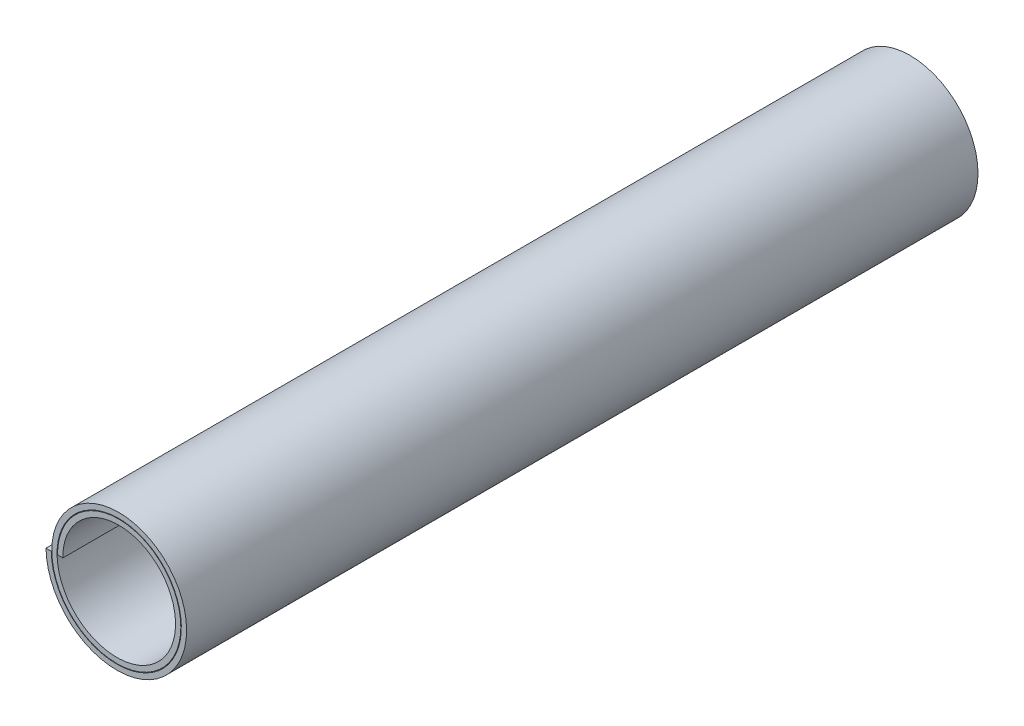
ISO-10303-21;
HEADER;
FILE_DESCRIPTION(('STEP AP214'),'2;1');
FILE_NAME('part.step','',(''),(''),'','','');
FILE_SCHEMA(('AUTOMOTIVE_DESIGN { 1 0 10303 214 1 1 1 1 }'));
ENDSEC;
DATA;
#1=APPLICATION_CONTEXT('core data for automotive mechanical design processes');
#2=APPLICATION_PROTOCOL_DEFINITION('international standard','automotive_design',2000,#1);
#3=PRODUCT_CONTEXT('',#1,'mechanical');
#4=PRODUCT('Part','Part','',(#3));
#5=PRODUCT_RELATED_PRODUCT_CATEGORY('part','',(#4));
#6=PRODUCT_DEFINITION_FORMATION('','',#4);
#7=PRODUCT_DEFINITION_CONTEXT('part definition',#1,'design');
#8=PRODUCT_DEFINITION('design','',#6,#7);
#9=PRODUCT_DEFINITION_SHAPE('','',#8);
#10=(LENGTH_UNIT() NAMED_UNIT(*) SI_UNIT(.MILLI.,.METRE.));
#11=(NAMED_UNIT(*) PLANE_ANGLE_UNIT() SI_UNIT($,.RADIAN.));
#12=(NAMED_UNIT(*) SI_UNIT($,.STERADIAN.) SOLID_ANGLE_UNIT());
#13=UNCERTAINTY_MEASURE_WITH_UNIT(LENGTH_MEASURE(1.E-05),#10,'distance_accuracy_value','');
#14=(GEOMETRIC_REPRESENTATION_CONTEXT(3) GLOBAL_UNCERTAINTY_ASSIGNED_CONTEXT((#13)) GLOBAL_UNIT_ASSIGNED_CONTEXT((#10,
#11,#12)) REPRESENTATION_CONTEXT('',''));
#15=CARTESIAN_POINT('',(0.,0.,0.));
#16=DIRECTION('',(0.,0.,1.));
#17=DIRECTION('',(1.,0.,0.));
#18=AXIS2_PLACEMENT_3D('',#15,#16,#17);
#19=CARTESIAN_POINT('',(-1.7272,0.,-9.52499999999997));
#20=DIRECTION('',(0.,1.,0.));
#21=DIRECTION('',(0.,0.,1.));
#22=AXIS2_PLACEMENT_3D('',#19,#20,#21);
#23=PLANE('',#22);
#24=DIRECTION('',(0.,0.,1.));
#25=VECTOR('',#24,1.);
#26=CARTESIAN_POINT('',(-1.7272,0.,-19.0499999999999));
#27=LINE('',#26,#25);
#28=CARTESIAN_POINT('',(-1.7272,0.,-19.0499999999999));
#29=VERTEX_POINT('',#28);
#30=CARTESIAN_POINT('',(-1.7272,0.,0.));
#31=VERTEX_POINT('',#30);
#32=EDGE_CURVE('E52',#29,#31,#27,.T.);
#33=ORIENTED_EDGE('',*,*,#32,.T.);
#34=DIRECTION('',(1.,0.,0.));
#35=VECTOR('',#34,1.);
#36=CARTESIAN_POINT('',(-1.7272,0.,0.));
#37=LINE('',#36,#35);
#38=CARTESIAN_POINT('',(-1.6002,0.,0.));
#39=VERTEX_POINT('',#38);
#40=EDGE_CURVE('E61',#31,#39,#37,.T.);
#41=ORIENTED_EDGE('',*,*,#40,.T.);
#42=DIRECTION('',(0.,0.,-1.));
#43=VECTOR('',#42,1.);
#44=CARTESIAN_POINT('',(-1.6002,0.,0.));
#45=LINE('',#44,#43);
#46=CARTESIAN_POINT('',(-1.6002,0.,-19.0499999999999));
#47=VERTEX_POINT('',#46);
#48=EDGE_CURVE('E94',#39,#47,#45,.T.);
#49=ORIENTED_EDGE('',*,*,#48,.T.);
#50=DIRECTION('',(-1.,0.,0.));
#51=VECTOR('',#50,1.);
#52=CARTESIAN_POINT('',(-1.6002,0.,-19.0499999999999));
#53=LINE('',#52,#51);
#54=EDGE_CURVE('E88',#47,#29,#53,.T.);
#55=ORIENTED_EDGE('',*,*,#54,.T.);
#56=EDGE_LOOP('',(#33,#41,#49,#55));
#57=FACE_BOUND('',#56,.T.);
#58=ADVANCED_FACE('F42',(#57),#23,.T.);
#59=CARTESIAN_POINT('',(-1.4478,0.,-9.52499999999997));
#60=DIRECTION('',(0.00248373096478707,-0.99999691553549,0.));
#61=DIRECTION('',(0.99999691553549,0.00248373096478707,0.));
#62=AXIS2_PLACEMENT_3D('',#59,#60,#61);
#63=PLANE('',#62);
#64=DIRECTION('',(0.,0.,1.));
#65=VECTOR('',#64,1.);
#66=CARTESIAN_POINT('',(-1.4478,0.,-9.52499999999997));
#67=LINE('',#66,#65);
#68=CARTESIAN_POINT('',(-1.4478,0.,-19.0499999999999));
#69=VERTEX_POINT('',#68);
#70=CARTESIAN_POINT('',(-1.4478,0.,0.));
#71=VERTEX_POINT('',#70);
#72=EDGE_CURVE('E13',#69,#71,#67,.T.);
#73=ORIENTED_EDGE('',*,*,#72,.F.);
#74=DIRECTION('',(-0.99999691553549,-0.00248373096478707,0.));
#75=VECTOR('',#74,1.);
#76=CARTESIAN_POINT('',(-1.32080039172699,0.000315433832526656,-19.0499999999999));
#77=LINE('',#76,#75);
#78=CARTESIAN_POINT('',(-1.32080039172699,0.000315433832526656,-19.0499999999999));
#79=VERTEX_POINT('',#78);
#80=EDGE_CURVE('E74',#79,#69,#77,.T.);
#81=ORIENTED_EDGE('',*,*,#80,.F.);
#82=DIRECTION('',(0.,0.,-1.));
#83=VECTOR('',#82,1.);
#84=CARTESIAN_POINT('',(-1.32080039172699,0.000315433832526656,-9.52499999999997));
#85=LINE('',#84,#83);
#86=CARTESIAN_POINT('',(-1.32080039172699,0.000315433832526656,0.));
#87=VERTEX_POINT('',#86);
#88=EDGE_CURVE('E100',#87,#79,#85,.T.);
#89=ORIENTED_EDGE('',*,*,#88,.F.);
#90=DIRECTION('',(0.99999691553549,0.00248373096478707,0.));
#91=VECTOR('',#90,1.);
#92=CARTESIAN_POINT('',(-1.3843001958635,0.00015771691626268,0.));
#93=LINE('',#92,#91);
#94=EDGE_CURVE('E103',#71,#87,#93,.T.);
#95=ORIENTED_EDGE('',*,*,#94,.F.);
#96=EDGE_LOOP('',(#73,#81,#89,#95));
#97=FACE_BOUND('',#96,.T.);
#98=ADVANCED_FACE('F151',(#97),#63,.T.);
#99=CARTESIAN_POINT('',(-1.7272,0.,-19.0499999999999));
#100=CARTESIAN_POINT('',(-1.72428957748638,-0.226089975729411,-19.0499999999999));
#101=CARTESIAN_POINT('',(-1.67643041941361,-0.450919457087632,-19.0499999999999));
#102=CARTESIAN_POINT('',(-1.49888579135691,-0.864339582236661,-19.0499999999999));
#103=CARTESIAN_POINT('',(-1.36927825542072,-1.05277164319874,-19.0499999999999));
#104=CARTESIAN_POINT('',(-1.04865570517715,-1.36516231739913,-19.0499999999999));
#105=CARTESIAN_POINT('',(-0.857772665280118,-1.48900502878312,-19.0499999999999));
#106=CARTESIAN_POINT('',(-0.444121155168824,-1.65404468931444,-19.0499999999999));
#107=CARTESIAN_POINT('',(-0.22151813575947,-1.69518540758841,-19.0499999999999));
#108=CARTESIAN_POINT('',(0.22151813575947,-1.68936459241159,-19.0499999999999));
#109=CARTESIAN_POINT('',(0.441777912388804,-1.64241442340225,-19.0499999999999));
#110=CARTESIAN_POINT('',(0.846750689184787,-1.46836880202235,-19.0499999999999));
#111=CARTESIAN_POINT('',(1.03130859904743,-1.34134989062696,-19.0499999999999));
#112=CARTESIAN_POINT('',(1.33723395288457,-1.02719266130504,-19.0499999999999));
#113=CARTESIAN_POINT('',(1.45848803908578,-0.840183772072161,-19.0499999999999));
#114=CARTESIAN_POINT('',(1.62002869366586,-0.43497961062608,-19.0499999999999));
#115=CARTESIAN_POINT('',(1.66026040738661,-0.21694646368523,-19.0499999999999));
#116=CARTESIAN_POINT('',(1.6544395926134,0.216946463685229,-19.0499999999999));
#117=CARTESIAN_POINT('',(1.60839842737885,0.432636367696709,-19.0499999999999));
#118=CARTESIAN_POINT('',(1.43785181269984,0.82916179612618,-19.0499999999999));
#119=CARTESIAN_POINT('',(1.31342152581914,1.00984555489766,-19.0499999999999));
#120=CARTESIAN_POINT('',(1.00572961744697,1.30930558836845,-19.0499999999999));
#121=CARTESIAN_POINT('',(0.822594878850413,1.42797104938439,-19.0499999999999));
#122=CARTESIAN_POINT('',(0.425838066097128,1.58601269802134,-19.0499999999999));
#123=CARTESIAN_POINT('',(0.212374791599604,1.62533540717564,-19.0499999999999));
#124=CARTESIAN_POINT('',(-0.212374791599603,1.61951459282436,-19.0499999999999));
#125=CARTESIAN_POINT('',(-0.423494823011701,1.57438243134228,-19.0499999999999));
#126=CARTESIAN_POINT('',(-0.811572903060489,1.4073348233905,-19.0499999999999));
#127=CARTESIAN_POINT('',(-0.988382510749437,1.28549316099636,-19.0499999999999));
#128=CARTESIAN_POINT('',(-1.28137722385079,0.984266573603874,-19.0499999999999));
#129=CARTESIAN_POINT('',(-1.39745405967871,0.805005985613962,-19.0499999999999));
#130=CARTESIAN_POINT('',(-1.55199670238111,0.416696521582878,-19.0499999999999));
#131=CARTESIAN_POINT('',(-1.59041040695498,0.207803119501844,-19.0499999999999));
#132=CARTESIAN_POINT('',(-1.58458959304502,-0.207803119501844,-19.0499999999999));
#133=CARTESIAN_POINT('',(-1.5403664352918,-0.414353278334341,-19.0499999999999));
#134=CARTESIAN_POINT('',(-1.37681783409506,-0.793984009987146,-19.0499999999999));
#135=CARTESIAN_POINT('',(-1.25756479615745,-0.966919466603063,-19.0499999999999));
#136=CARTESIAN_POINT('',(-0.962803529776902,-1.25344885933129,-19.0499999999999));
#137=CARTESIAN_POINT('',(-0.787417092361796,-1.36693706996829,-19.0499999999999));
#138=CARTESIAN_POINT('',(-0.407554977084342,-1.51798070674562,-19.0499999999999));
#139=CARTESIAN_POINT('',(-0.203231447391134,-1.55548540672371,-19.0499999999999));
#140=CARTESIAN_POINT('',(0.203231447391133,-1.5496645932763,-19.0499999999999));
#141=CARTESIAN_POINT('',(0.405211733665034,-1.50635043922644,-19.0499999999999));
#142=CARTESIAN_POINT('',(0.776395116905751,-1.3463008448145,-19.0499999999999));
#143=CARTESIAN_POINT('',(0.945456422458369,-1.22963643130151,-19.0499999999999));
#144=CARTESIAN_POINT('',(1.2255204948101,-0.941340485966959,-19.0499999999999));
#145=CARTESIAN_POINT('',(1.3364200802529,-0.769828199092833,-19.0499999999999));
#146=CARTESIAN_POINT('',(1.48396471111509,-0.398413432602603,-19.0499999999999));
#147=CARTESIAN_POINT('',(1.52056040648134,-0.198659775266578,-19.0499999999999));
#148=CARTESIAN_POINT('',(1.51473959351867,0.198659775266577,-19.0499999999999));
#149=CARTESIAN_POINT('',(1.47233444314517,0.396070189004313,-19.0499999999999));
#150=CARTESIAN_POINT('',(1.31578385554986,0.75880622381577,-19.0499999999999));
#151=CARTESIAN_POINT('',(1.20170806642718,0.923993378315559,-19.0499999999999));
#152=CARTESIAN_POINT('',(0.919877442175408,1.19759213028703,-19.0499999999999));
#153=CARTESIAN_POINT('',(0.75223930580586,1.30590309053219,-19.0499999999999));
#154=CARTESIAN_POINT('',(0.389271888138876,1.44994871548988,-19.0499999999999));
#155=CARTESIAN_POINT('',(0.194088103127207,1.48563540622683,-19.0499999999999));
#156=CARTESIAN_POINT('',(-0.194088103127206,1.47981459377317,-19.0499999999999));
#157=CARTESIAN_POINT('',(-0.386928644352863,1.43831844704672,-19.0499999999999));
#158=CARTESIAN_POINT('',(-0.74121733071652,1.2852668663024,-19.0499999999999));
#159=CARTESIAN_POINT('',(-0.902530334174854,1.17377970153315,-19.0499999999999));
#160=CARTESIAN_POINT('',(-1.16966376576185,0.898414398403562,-19.0499999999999));
#161=CARTESIAN_POINT('',(-1.27538610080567,0.734650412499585,-19.0499999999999));
#162=CARTESIAN_POINT('',(-1.41593271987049,0.380130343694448,-19.0499999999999));
#163=CARTESIAN_POINT('',(-1.45071041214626,0.189516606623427,-19.0499999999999));
#164=CARTESIAN_POINT('',(-1.4478,0.,-19.0499999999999));
#165=CARTESIAN_POINT('',(-1.7272,0.,0.));
#166=CARTESIAN_POINT('',(-1.72428957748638,-0.22608997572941,0.));
#167=CARTESIAN_POINT('',(-1.67643041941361,-0.450919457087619,0.));
#168=CARTESIAN_POINT('',(-1.4988857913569,-0.864339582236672,0.));
#169=CARTESIAN_POINT('',(-1.36927825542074,-1.05277164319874,0.));
#170=CARTESIAN_POINT('',(-1.04865570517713,-1.36516231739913,0.));
#171=CARTESIAN_POINT('',(-0.857772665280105,-1.48900502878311,0.));
#172=CARTESIAN_POINT('',(-0.444121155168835,-1.65404468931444,0.));
#173=CARTESIAN_POINT('',(-0.22151813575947,-1.69518540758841,0.));
#174=CARTESIAN_POINT('',(0.22151813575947,-1.68936459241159,0.));
#175=CARTESIAN_POINT('',(0.441777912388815,-1.64241442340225,0.));
#176=CARTESIAN_POINT('',(0.846750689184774,-1.46836880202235,0.));
#177=CARTESIAN_POINT('',(1.0313085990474,-1.34134989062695,0.));
#178=CARTESIAN_POINT('',(1.33723395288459,-1.02719266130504,0.));
#179=CARTESIAN_POINT('',(1.45848803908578,-0.84018377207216,0.));
#180=CARTESIAN_POINT('',(1.62002869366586,-0.434979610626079,0.));
#181=CARTESIAN_POINT('',(1.66026040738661,-0.216946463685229,0.));
#182=CARTESIAN_POINT('',(1.65443959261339,0.216946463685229,0.));
#183=CARTESIAN_POINT('',(1.60839842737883,0.432636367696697,0.));
#184=CARTESIAN_POINT('',(1.43785181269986,0.829161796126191,0.));
#185=CARTESIAN_POINT('',(1.31342152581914,1.00984555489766,0.));
#186=CARTESIAN_POINT('',(1.00572961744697,1.30930558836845,0.));
#187=CARTESIAN_POINT('',(0.822594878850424,1.42797104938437,0.));
#188=CARTESIAN_POINT('',(0.425838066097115,1.58601269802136,0.));
#189=CARTESIAN_POINT('',(0.212374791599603,1.62533540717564,0.));
#190=CARTESIAN_POINT('',(-0.212374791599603,1.61951459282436,0.));
#191=CARTESIAN_POINT('',(-0.423494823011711,1.57438243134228,0.));
#192=CARTESIAN_POINT('',(-0.811572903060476,1.40733482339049,0.));
#193=CARTESIAN_POINT('',(-0.988382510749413,1.28549316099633,0.));
#194=CARTESIAN_POINT('',(-1.28137722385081,0.984266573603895,0.));
#195=CARTESIAN_POINT('',(-1.39745405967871,0.805005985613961,0.));
#196=CARTESIAN_POINT('',(-1.55199670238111,0.416696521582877,0.));
#197=CARTESIAN_POINT('',(-1.59041040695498,0.207803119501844,0.));
#198=CARTESIAN_POINT('',(-1.58458959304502,-0.207803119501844,0.));
#199=CARTESIAN_POINT('',(-1.5403664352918,-0.41435327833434,0.));
#200=CARTESIAN_POINT('',(-1.37681783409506,-0.793984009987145,0.));
#201=CARTESIAN_POINT('',(-1.25756479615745,-0.966919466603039,0.));
#202=CARTESIAN_POINT('',(-0.962803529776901,-1.25344885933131,0.));
#203=CARTESIAN_POINT('',(-0.787417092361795,-1.36693706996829,0.));
#204=CARTESIAN_POINT('',(-0.407554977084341,-1.51798070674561,0.));
#205=CARTESIAN_POINT('',(-0.203231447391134,-1.5554854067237,0.));
#206=CARTESIAN_POINT('',(0.203231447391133,-1.5496645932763,0.));
#207=CARTESIAN_POINT('',(0.405211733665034,-1.50635043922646,0.));
#208=CARTESIAN_POINT('',(0.77639511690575,-1.34630084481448,0.));
#209=CARTESIAN_POINT('',(0.945456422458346,-1.22963643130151,0.));
#210=CARTESIAN_POINT('',(1.22552049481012,-0.941340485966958,0.));
#211=CARTESIAN_POINT('',(1.33642008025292,-0.769828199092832,0.));
#212=CARTESIAN_POINT('',(1.48396471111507,-0.398413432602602,0.));
#213=CARTESIAN_POINT('',(1.52056040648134,-0.198659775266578,0.));
#214=CARTESIAN_POINT('',(1.51473959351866,0.198659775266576,0.));
#215=CARTESIAN_POINT('',(1.47233444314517,0.396070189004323,0.));
#216=CARTESIAN_POINT('',(1.31578385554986,0.758806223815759,0.));
#217=CARTESIAN_POINT('',(1.20170806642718,0.923993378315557,0.));
#218=CARTESIAN_POINT('',(0.919877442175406,1.19759213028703,0.));
#219=CARTESIAN_POINT('',(0.752239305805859,1.30590309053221,0.));
#220=CARTESIAN_POINT('',(0.389271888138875,1.44994871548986,0.));
#221=CARTESIAN_POINT('',(0.194088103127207,1.48563540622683,0.));
#222=CARTESIAN_POINT('',(-0.194088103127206,1.47981459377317,0.));
#223=CARTESIAN_POINT('',(-0.386928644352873,1.43831844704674,0.));
#224=CARTESIAN_POINT('',(-0.741217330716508,1.28526686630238,0.));
#225=CARTESIAN_POINT('',(-0.902530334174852,1.17377970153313,0.));
#226=CARTESIAN_POINT('',(-1.16966376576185,0.898414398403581,0.));
#227=CARTESIAN_POINT('',(-1.27538610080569,0.734650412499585,0.));
#228=CARTESIAN_POINT('',(-1.41593271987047,0.380130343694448,0.));
#229=CARTESIAN_POINT('',(-1.45071041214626,0.189516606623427,0.));
#230=CARTESIAN_POINT('',(-1.4478,0.,0.));
#231=B_SPLINE_SURFACE_WITH_KNOTS('',1,3,((#99,#100,#101,#102,#103,#104,#105,#106,#107,#108,#109,
#110,#111,#112,#113,#114,#115,#116,#117,#118,#119,#120,#121,#122,#123,#124,#125,#126,#127,#128,
#129,#130,#131,#132,#133,#134,#135,#136,#137,#138,#139,#140,#141,#142,#143,#144,#145,#146,#147,
#148,#149,#150,#151,#152,#153,#154,#155,#156,#157,#158,#159,#160,#161,#162,#163,#164),(#165,
#166,#167,#168,#169,#170,#171,#172,#173,#174,#175,#176,#177,#178,#179,#180,#181,#182,#183,#184,
#185,#186,#187,#188,#189,#190,#191,#192,#193,#194,#195,#196,#197,#198,#199,#200,#201,#202,#203,
#204,#205,#206,#207,#208,#209,#210,#211,#212,#213,#214,#215,#216,#217,#218,#219,#220,#221,#222,
#223,#224,#225,#226,#227,#228,#229,#230)),.UNSPECIFIED.,.F.,.F.,.F.,(2,2),(4,2,2,2,2,2,2,2,2,2,
2,2,2,2,2,2,2,2,2,2,2,2,2,2,2,2,2,2,2,2,2,2,4),(0.,0.496688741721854),(0.,0.03125,0.0625,
0.09375,0.125,0.15625,0.1875,0.21875,0.25,0.28125,0.3125,0.34375,0.375,0.40625,0.4375,0.46875,
0.5,0.53125,0.5625,0.59375,0.625,0.65625,0.6875,0.71875,0.75,0.78125,0.8125,0.84375,0.875,
0.90625,0.9375,0.96875,1.),.UNSPECIFIED.);
#232=CARTESIAN_POINT('',(-1.7272,0.,-19.0499999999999));
#233=CARTESIAN_POINT('',(-1.72428957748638,-0.226089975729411,-19.0499999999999));
#234=CARTESIAN_POINT('',(-1.67643041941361,-0.450919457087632,-19.0499999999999));
#235=CARTESIAN_POINT('',(-1.49888579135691,-0.864339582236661,-19.0499999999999));
#236=CARTESIAN_POINT('',(-1.36927825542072,-1.05277164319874,-19.0499999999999));
#237=CARTESIAN_POINT('',(-1.04865570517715,-1.36516231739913,-19.0499999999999));
#238=CARTESIAN_POINT('',(-0.857772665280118,-1.48900502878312,-19.0499999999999));
#239=CARTESIAN_POINT('',(-0.444121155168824,-1.65404468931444,-19.0499999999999));
#240=CARTESIAN_POINT('',(-0.22151813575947,-1.69518540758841,-19.0499999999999));
#241=CARTESIAN_POINT('',(0.22151813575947,-1.68936459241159,-19.0499999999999));
#242=CARTESIAN_POINT('',(0.441777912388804,-1.64241442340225,-19.0499999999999));
#243=CARTESIAN_POINT('',(0.846750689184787,-1.46836880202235,-19.0499999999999));
#244=CARTESIAN_POINT('',(1.03130859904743,-1.34134989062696,-19.0499999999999));
#245=CARTESIAN_POINT('',(1.33723395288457,-1.02719266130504,-19.0499999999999));
#246=CARTESIAN_POINT('',(1.45848803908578,-0.840183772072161,-19.0499999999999));
#247=CARTESIAN_POINT('',(1.62002869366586,-0.43497961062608,-19.0499999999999));
#248=CARTESIAN_POINT('',(1.66026040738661,-0.21694646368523,-19.0499999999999));
#249=CARTESIAN_POINT('',(1.6544395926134,0.216946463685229,-19.0499999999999));
#250=CARTESIAN_POINT('',(1.60839842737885,0.432636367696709,-19.0499999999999));
#251=CARTESIAN_POINT('',(1.43785181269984,0.82916179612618,-19.0499999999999));
#252=CARTESIAN_POINT('',(1.31342152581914,1.00984555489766,-19.0499999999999));
#253=CARTESIAN_POINT('',(1.00572961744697,1.30930558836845,-19.0499999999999));
#254=CARTESIAN_POINT('',(0.822594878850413,1.42797104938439,-19.0499999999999));
#255=CARTESIAN_POINT('',(0.425838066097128,1.58601269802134,-19.0499999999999));
#256=CARTESIAN_POINT('',(0.212374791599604,1.62533540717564,-19.0499999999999));
#257=CARTESIAN_POINT('',(-0.212374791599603,1.61951459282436,-19.0499999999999));
#258=CARTESIAN_POINT('',(-0.423494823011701,1.57438243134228,-19.0499999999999));
#259=CARTESIAN_POINT('',(-0.811572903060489,1.4073348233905,-19.0499999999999));
#260=CARTESIAN_POINT('',(-0.988382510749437,1.28549316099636,-19.0499999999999));
#261=CARTESIAN_POINT('',(-1.28137722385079,0.984266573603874,-19.0499999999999));
#262=CARTESIAN_POINT('',(-1.39745405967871,0.805005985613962,-19.0499999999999));
#263=CARTESIAN_POINT('',(-1.55199670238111,0.416696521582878,-19.0499999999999));
#264=CARTESIAN_POINT('',(-1.59041040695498,0.207803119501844,-19.0499999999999));
#265=CARTESIAN_POINT('',(-1.58458959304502,-0.207803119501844,-19.0499999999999));
#266=CARTESIAN_POINT('',(-1.5403664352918,-0.414353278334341,-19.0499999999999));
#267=CARTESIAN_POINT('',(-1.37681783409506,-0.793984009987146,-19.0499999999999));
#268=CARTESIAN_POINT('',(-1.25756479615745,-0.966919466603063,-19.0499999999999));
#269=CARTESIAN_POINT('',(-0.962803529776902,-1.25344885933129,-19.0499999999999));
#270=CARTESIAN_POINT('',(-0.787417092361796,-1.36693706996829,-19.0499999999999));
#271=CARTESIAN_POINT('',(-0.407554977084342,-1.51798070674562,-19.0499999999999));
#272=CARTESIAN_POINT('',(-0.203231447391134,-1.55548540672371,-19.0499999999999));
#273=CARTESIAN_POINT('',(0.203231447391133,-1.5496645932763,-19.0499999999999));
#274=CARTESIAN_POINT('',(0.405211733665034,-1.50635043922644,-19.0499999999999));
#275=CARTESIAN_POINT('',(0.776395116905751,-1.3463008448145,-19.0499999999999));
#276=CARTESIAN_POINT('',(0.945456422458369,-1.22963643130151,-19.0499999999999));
#277=CARTESIAN_POINT('',(1.2255204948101,-0.941340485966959,-19.0499999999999));
#278=CARTESIAN_POINT('',(1.3364200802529,-0.769828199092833,-19.0499999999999));
#279=CARTESIAN_POINT('',(1.48396471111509,-0.398413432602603,-19.0499999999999));
#280=CARTESIAN_POINT('',(1.52056040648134,-0.198659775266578,-19.0499999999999));
#281=CARTESIAN_POINT('',(1.51473959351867,0.198659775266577,-19.0499999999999));
#282=CARTESIAN_POINT('',(1.47233444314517,0.396070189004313,-19.0499999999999));
#283=CARTESIAN_POINT('',(1.31578385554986,0.75880622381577,-19.0499999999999));
#284=CARTESIAN_POINT('',(1.20170806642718,0.923993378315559,-19.0499999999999));
#285=CARTESIAN_POINT('',(0.919877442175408,1.19759213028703,-19.0499999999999));
#286=CARTESIAN_POINT('',(0.75223930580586,1.30590309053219,-19.0499999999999));
#287=CARTESIAN_POINT('',(0.389271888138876,1.44994871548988,-19.0499999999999));
#288=CARTESIAN_POINT('',(0.194088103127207,1.48563540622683,-19.0499999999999));
#289=CARTESIAN_POINT('',(-0.194088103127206,1.47981459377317,-19.0499999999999));
#290=CARTESIAN_POINT('',(-0.386928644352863,1.43831844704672,-19.0499999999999));
#291=CARTESIAN_POINT('',(-0.74121733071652,1.2852668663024,-19.0499999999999));
#292=CARTESIAN_POINT('',(-0.902530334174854,1.17377970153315,-19.0499999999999));
#293=CARTESIAN_POINT('',(-1.16966376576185,0.898414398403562,-19.0499999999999));
#294=CARTESIAN_POINT('',(-1.27538610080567,0.734650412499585,-19.0499999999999));
#295=CARTESIAN_POINT('',(-1.41593271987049,0.380130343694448,-19.0499999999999));
#296=CARTESIAN_POINT('',(-1.45071041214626,0.189516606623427,-19.0499999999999));
#297=CARTESIAN_POINT('',(-1.4478,0.,-19.0499999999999));
#298=B_SPLINE_CURVE_WITH_KNOTS('',3,(#232,#233,#234,#235,#236,#237,#238,#239,#240,#241,#242,
#243,#244,#245,#246,#247,#248,#249,#250,#251,#252,#253,#254,#255,#256,#257,#258,#259,#260,#261,
#262,#263,#264,#265,#266,#267,#268,#269,#270,#271,#272,#273,#274,#275,#276,#277,#278,#279,#280,
#281,#282,#283,#284,#285,#286,#287,#288,#289,#290,#291,#292,#293,#294,#295,#296,#297),
.UNSPECIFIED.,.F.,.F.,(4,2,2,2,2,2,2,2,2,2,2,2,2,2,2,2,2,2,2,2,2,2,2,2,2,2,2,2,2,2,2,2,4),(0.,
0.03125,0.0625,0.09375,0.125,0.15625,0.1875,0.21875,0.25,0.28125,0.3125,0.34375,0.375,0.40625,
0.4375,0.46875,0.5,0.53125,0.5625,0.59375,0.625,0.65625,0.6875,0.71875,0.75,0.78125,0.8125,
0.84375,0.875,0.90625,0.9375,0.96875,1.),.UNSPECIFIED.);
#299=EDGE_CURVE('E117',#29,#69,#298,.T.);
#300=CARTESIAN_POINT('',(-1.7272,0.,0.));
#301=CARTESIAN_POINT('',(-1.72428957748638,-0.22608997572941,0.));
#302=CARTESIAN_POINT('',(-1.67643041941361,-0.450919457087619,0.));
#303=CARTESIAN_POINT('',(-1.4988857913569,-0.864339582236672,0.));
#304=CARTESIAN_POINT('',(-1.36927825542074,-1.05277164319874,0.));
#305=CARTESIAN_POINT('',(-1.04865570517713,-1.36516231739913,0.));
#306=CARTESIAN_POINT('',(-0.857772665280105,-1.48900502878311,0.));
#307=CARTESIAN_POINT('',(-0.444121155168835,-1.65404468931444,0.));
#308=CARTESIAN_POINT('',(-0.22151813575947,-1.69518540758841,0.));
#309=CARTESIAN_POINT('',(0.22151813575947,-1.68936459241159,0.));
#310=CARTESIAN_POINT('',(0.441777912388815,-1.64241442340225,0.));
#311=CARTESIAN_POINT('',(0.846750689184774,-1.46836880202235,0.));
#312=CARTESIAN_POINT('',(1.0313085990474,-1.34134989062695,0.));
#313=CARTESIAN_POINT('',(1.33723395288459,-1.02719266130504,0.));
#314=CARTESIAN_POINT('',(1.45848803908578,-0.84018377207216,0.));
#315=CARTESIAN_POINT('',(1.62002869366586,-0.434979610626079,0.));
#316=CARTESIAN_POINT('',(1.66026040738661,-0.216946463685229,0.));
#317=CARTESIAN_POINT('',(1.65443959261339,0.216946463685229,0.));
#318=CARTESIAN_POINT('',(1.60839842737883,0.432636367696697,0.));
#319=CARTESIAN_POINT('',(1.43785181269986,0.829161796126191,0.));
#320=CARTESIAN_POINT('',(1.31342152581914,1.00984555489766,0.));
#321=CARTESIAN_POINT('',(1.00572961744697,1.30930558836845,0.));
#322=CARTESIAN_POINT('',(0.822594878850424,1.42797104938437,0.));
#323=CARTESIAN_POINT('',(0.425838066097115,1.58601269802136,0.));
#324=CARTESIAN_POINT('',(0.212374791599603,1.62533540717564,0.));
#325=CARTESIAN_POINT('',(-0.212374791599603,1.61951459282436,0.));
#326=CARTESIAN_POINT('',(-0.423494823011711,1.57438243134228,0.));
#327=CARTESIAN_POINT('',(-0.811572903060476,1.40733482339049,0.));
#328=CARTESIAN_POINT('',(-0.988382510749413,1.28549316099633,0.));
#329=CARTESIAN_POINT('',(-1.28137722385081,0.984266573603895,0.));
#330=CARTESIAN_POINT('',(-1.39745405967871,0.805005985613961,0.));
#331=CARTESIAN_POINT('',(-1.55199670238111,0.416696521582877,0.));
#332=CARTESIAN_POINT('',(-1.59041040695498,0.207803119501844,0.));
#333=CARTESIAN_POINT('',(-1.58458959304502,-0.207803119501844,0.));
#334=CARTESIAN_POINT('',(-1.5403664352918,-0.41435327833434,0.));
#335=CARTESIAN_POINT('',(-1.37681783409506,-0.793984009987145,0.));
#336=CARTESIAN_POINT('',(-1.25756479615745,-0.966919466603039,0.));
#337=CARTESIAN_POINT('',(-0.962803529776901,-1.25344885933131,0.));
#338=CARTESIAN_POINT('',(-0.787417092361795,-1.36693706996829,0.));
#339=CARTESIAN_POINT('',(-0.407554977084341,-1.51798070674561,0.));
#340=CARTESIAN_POINT('',(-0.203231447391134,-1.5554854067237,0.));
#341=CARTESIAN_POINT('',(0.203231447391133,-1.5496645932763,0.));
#342=CARTESIAN_POINT('',(0.405211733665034,-1.50635043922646,0.));
#343=CARTESIAN_POINT('',(0.77639511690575,-1.34630084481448,0.));
#344=CARTESIAN_POINT('',(0.945456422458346,-1.22963643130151,0.));
#345=CARTESIAN_POINT('',(1.22552049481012,-0.941340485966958,0.));
#346=CARTESIAN_POINT('',(1.33642008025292,-0.769828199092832,0.));
#347=CARTESIAN_POINT('',(1.48396471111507,-0.398413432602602,0.));
#348=CARTESIAN_POINT('',(1.52056040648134,-0.198659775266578,0.));
#349=CARTESIAN_POINT('',(1.51473959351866,0.198659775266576,0.));
#350=CARTESIAN_POINT('',(1.47233444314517,0.396070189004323,0.));
#351=CARTESIAN_POINT('',(1.31578385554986,0.758806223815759,0.));
#352=CARTESIAN_POINT('',(1.20170806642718,0.923993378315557,0.));
#353=CARTESIAN_POINT('',(0.919877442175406,1.19759213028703,0.));
#354=CARTESIAN_POINT('',(0.752239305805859,1.30590309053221,0.));
#355=CARTESIAN_POINT('',(0.389271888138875,1.44994871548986,0.));
#356=CARTESIAN_POINT('',(0.194088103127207,1.48563540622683,0.));
#357=CARTESIAN_POINT('',(-0.194088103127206,1.47981459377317,0.));
#358=CARTESIAN_POINT('',(-0.386928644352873,1.43831844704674,0.));
#359=CARTESIAN_POINT('',(-0.741217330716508,1.28526686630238,0.));
#360=CARTESIAN_POINT('',(-0.902530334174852,1.17377970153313,0.));
#361=CARTESIAN_POINT('',(-1.16966376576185,0.898414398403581,0.));
#362=CARTESIAN_POINT('',(-1.27538610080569,0.734650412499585,0.));
#363=CARTESIAN_POINT('',(-1.41593271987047,0.380130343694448,0.));
#364=CARTESIAN_POINT('',(-1.45071041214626,0.189516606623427,0.));
#365=CARTESIAN_POINT('',(-1.4478,0.,0.));
#366=B_SPLINE_CURVE_WITH_KNOTS('',3,(#300,#301,#302,#303,#304,#305,#306,#307,#308,#309,#310,
#311,#312,#313,#314,#315,#316,#317,#318,#319,#320,#321,#322,#323,#324,#325,#326,#327,#328,#329,
#330,#331,#332,#333,#334,#335,#336,#337,#338,#339,#340,#341,#342,#343,#344,#345,#346,#347,#348,
#349,#350,#351,#352,#353,#354,#355,#356,#357,#358,#359,#360,#361,#362,#363,#364,#365),
.UNSPECIFIED.,.F.,.F.,(4,2,2,2,2,2,2,2,2,2,2,2,2,2,2,2,2,2,2,2,2,2,2,2,2,2,2,2,2,2,2,2,4),(0.,
0.03125,0.0625,0.09375,0.125,0.15625,0.1875,0.21875,0.25,0.28125,0.3125,0.34375,0.375,0.40625,
0.4375,0.46875,0.5,0.53125,0.5625,0.59375,0.625,0.65625,0.6875,0.71875,0.75,0.78125,0.8125,
0.84375,0.875,0.90625,0.9375,0.96875,1.),.UNSPECIFIED.);
#367=EDGE_CURVE('E107',#31,#71,#366,.T.);
#368=ORIENTED_EDGE('',*,*,#32,.F.);
#369=ORIENTED_EDGE('',*,*,#299,.T.);
#370=ORIENTED_EDGE('',*,*,#72,.T.);
#371=ORIENTED_EDGE('',*,*,#367,.F.);
#372=EDGE_LOOP('',(#368,#369,#370,#371));
#373=FACE_BOUND('',#372,.T.);
#374=ADVANCED_FACE('F152',(#373),#231,.F.);
#375=CARTESIAN_POINT('',(-1.7272,0.,0.));
#376=DIRECTION('',(0.,0.,-1.));
#377=DIRECTION('',(1.,0.,0.));
#378=AXIS2_PLACEMENT_3D('',#375,#376,#377);
#379=PLANE('',#378);
#380=ORIENTED_EDGE('',*,*,#40,.F.);
#381=ORIENTED_EDGE('',*,*,#367,.T.);
#382=ORIENTED_EDGE('',*,*,#94,.T.);
#383=CARTESIAN_POINT('',(-1.6002,0.,0.));
#384=CARTESIAN_POINT('',(-1.59728957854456,-0.209254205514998,0.));
#385=CARTESIAN_POINT('',(-1.55265679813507,-0.417865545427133,0.));
#386=CARTESIAN_POINT('',(-1.38800036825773,-0.800176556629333,0.));
#387=CARTESIAN_POINT('',(-1.2675806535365,-0.974860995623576,0.));
#388=CARTESIAN_POINT('',(-0.970771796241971,-1.26344423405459,0.));
#389=CARTESIAN_POINT('',(-0.793638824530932,-1.37810271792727,0.));
#390=CARTESIAN_POINT('',(-0.411099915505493,-1.53026233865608,0.));
#391=CARTESIAN_POINT('',(-0.204715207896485,-1.56818094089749,0.));
#392=CARTESIAN_POINT('',(0.204647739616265,-1.56236906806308,0.));
#393=CARTESIAN_POINT('',(0.408690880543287,-1.51864963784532,0.));
#394=CARTESIAN_POINT('',(0.782557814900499,-1.35750064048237,0.));
#395=CARTESIAN_POINT('',(0.953370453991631,-1.23967334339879,0.));
#396=CARTESIAN_POINT('',(1.23549468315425,-0.949336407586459,0.));
#397=CARTESIAN_POINT('',(1.34756820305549,-0.776080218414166,0.));
#398=CARTESIAN_POINT('',(1.49623726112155,-0.401992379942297,0.));
#399=CARTESIAN_POINT('',(1.53325129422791,-0.200178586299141,0.));
#400=CARTESIAN_POINT('',(1.5274487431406,0.200040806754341,0.));
#401=CARTESIAN_POINT('',(1.48464286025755,0.399514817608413,0.));
#402=CARTESIAN_POINT('',(1.32700165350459,0.764937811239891,0.));
#403=CARTESIAN_POINT('',(1.21176693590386,0.931878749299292,0.));
#404=CARTESIAN_POINT('',(0.927902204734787,1.20754423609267,0.));
#405=CARTESIAN_POINT('',(0.758522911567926,1.3170329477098,0.));
#406=CARTESIAN_POINT('',(0.392886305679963,1.46221180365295,0.));
#407=CARTESIAN_POINT('',(0.19564347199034,1.49832145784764,0.));
#408=CARTESIAN_POINT('',(-0.195432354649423,1.49252862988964,0.));
#409=CARTESIAN_POINT('',(-0.390337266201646,1.45063649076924,0.));
#410=CARTESIAN_POINT('',(-0.747316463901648,1.29650345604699,0.));
#411=CARTESIAN_POINT('',(-0.910385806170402,1.18386149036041,0.));
#412=CARTESIAN_POINT('',(-1.17959283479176,0.906469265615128,0.));
#413=CARTESIAN_POINT('',(-1.28649690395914,0.740966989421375,0.));
#414=CARTESIAN_POINT('',(-1.42818594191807,0.383781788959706,0.));
#415=CARTESIAN_POINT('',(-1.46339141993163,0.191109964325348,0.));
#416=CARTESIAN_POINT('',(-1.45760874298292,-0.190822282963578,0.));
#417=CARTESIAN_POINT('',(-1.41663055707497,-0.381158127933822,0.));
#418=CARTESIAN_POINT('',(-1.26600610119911,-0.729693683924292,0.));
#419=CARTESIAN_POINT('',(-1.15595707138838,-0.888891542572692,0.));
#420=CARTESIAN_POINT('',(-0.885037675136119,-1.15164041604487,0.));
#421=CARTESIAN_POINT('',(-0.723412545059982,-1.25596001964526,0.));
#422=CARTESIAN_POINT('',(-0.3746789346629,-1.39415964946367,0.));
#423=CARTESIAN_POINT('',(-0.186578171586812,-1.4284611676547,0.));
#424=CARTESIAN_POINT('',(0.186210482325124,-1.4226890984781,0.));
#425=CARTESIAN_POINT('',(0.371977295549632,-1.38262508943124,0.));
#426=CARTESIAN_POINT('',(0.712069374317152,-1.2355096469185,0.));
#427=CARTESIAN_POINT('',(0.867395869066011,-1.12805374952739,0.));
#428=CARTESIAN_POINT('',(1.12368691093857,-0.863607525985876,0.));
#429=CARTESIAN_POINT('',(1.22542223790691,-0.705859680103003,0.));
#430=CARTESIAN_POINT('',(1.36013289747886,-0.365577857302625,0.));
#431=CARTESIAN_POINT('',(1.39353068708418,-0.182048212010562,0.));
#432=CARTESIAN_POINT('',(1.38776971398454,0.181596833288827,0.));
#433=CARTESIAN_POINT('',(1.34862012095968,0.362794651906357,0.));
#434=CARTESIAN_POINT('',(1.20501415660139,0.694443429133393,0.));
#435=CARTESIAN_POINT('',(1.10015160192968,0.845898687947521,0.));
#436=CARTESIAN_POINT('',(0.84217891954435,1.09573224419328,0.));
#437=CARTESIAN_POINT('',(0.688308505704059,1.19488349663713,0.));
#438=CARTESIAN_POINT('',(0.356478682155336,1.32610565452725,0.));
#439=CARTESIAN_POINT('',(0.177520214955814,1.35859996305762,0.));
#440=CARTESIAN_POINT('',(-0.176981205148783,1.35285060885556,0.));
#441=CARTESIAN_POINT('',(-0.353610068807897,1.31461568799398,0.));
#442=CARTESIAN_POINT('',(-0.67681573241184,1.17451969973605,0.));
#443=CARTESIAN_POINT('',(-0.824399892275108,1.07225071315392,0.));
#444=CARTESIAN_POINT('',(-1.06777633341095,0.820751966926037,0.));
#445=CARTESIAN_POINT('',(-1.16434372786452,0.670759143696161,0.));
#446=CARTESIAN_POINT('',(-1.29207788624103,0.347381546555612,0.));
#447=CARTESIAN_POINT('',(-1.32366897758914,0.172991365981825,0.));
#448=CARTESIAN_POINT('',(-1.32080039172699,0.000315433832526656,0.));
#449=B_SPLINE_CURVE_WITH_KNOTS('',3,(#383,#384,#385,#386,#387,#388,#389,#390,#391,#392,#393,
#394,#395,#396,#397,#398,#399,#400,#401,#402,#403,#404,#405,#406,#407,#408,#409,#410,#411,#412,
#413,#414,#415,#416,#417,#418,#419,#420,#421,#422,#423,#424,#425,#426,#427,#428,#429,#430,#431,
#432,#433,#434,#435,#436,#437,#438,#439,#440,#441,#442,#443,#444,#445,#446,#447,#448),
.UNSPECIFIED.,.F.,.F.,(4,2,2,2,2,2,2,2,2,2,2,2,2,2,2,2,2,2,2,2,2,2,2,2,2,2,2,2,2,2,2,2,4),(0.,
0.03125,0.0625,0.09375,0.125,0.15625,0.1875,0.21875,0.25,0.28125,0.3125,0.34375,0.375,0.40625,
0.4375,0.46875,0.5,0.53125,0.5625,0.59375,0.625,0.65625,0.6875,0.71875,0.75,0.78125,0.8125,
0.84375,0.875,0.90625,0.9375,0.96875,1.),.UNSPECIFIED.);
#450=EDGE_CURVE('E97',#39,#87,#449,.T.);
#451=ORIENTED_EDGE('',*,*,#450,.F.);
#452=EDGE_LOOP('',(#380,#381,#382,#451));
#453=FACE_BOUND('',#452,.T.);
#454=ADVANCED_FACE('F102',(#453),#379,.F.);
#455=CARTESIAN_POINT('',(-1.6002,0.,0.));
#456=CARTESIAN_POINT('',(-1.59728957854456,-0.209254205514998,0.));
#457=CARTESIAN_POINT('',(-1.55265679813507,-0.417865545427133,0.));
#458=CARTESIAN_POINT('',(-1.38800036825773,-0.800176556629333,0.));
#459=CARTESIAN_POINT('',(-1.2675806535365,-0.974860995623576,0.));
#460=CARTESIAN_POINT('',(-0.970771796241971,-1.26344423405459,0.));
#461=CARTESIAN_POINT('',(-0.793638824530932,-1.37810271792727,0.));
#462=CARTESIAN_POINT('',(-0.411099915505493,-1.53026233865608,0.));
#463=CARTESIAN_POINT('',(-0.204715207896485,-1.56818094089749,0.));
#464=CARTESIAN_POINT('',(0.204647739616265,-1.56236906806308,0.));
#465=CARTESIAN_POINT('',(0.408690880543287,-1.51864963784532,0.));
#466=CARTESIAN_POINT('',(0.782557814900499,-1.35750064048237,0.));
#467=CARTESIAN_POINT('',(0.953370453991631,-1.23967334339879,0.));
#468=CARTESIAN_POINT('',(1.23549468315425,-0.949336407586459,0.));
#469=CARTESIAN_POINT('',(1.34756820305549,-0.776080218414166,0.));
#470=CARTESIAN_POINT('',(1.49623726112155,-0.401992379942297,0.));
#471=CARTESIAN_POINT('',(1.53325129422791,-0.200178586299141,0.));
#472=CARTESIAN_POINT('',(1.5274487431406,0.200040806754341,0.));
#473=CARTESIAN_POINT('',(1.48464286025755,0.399514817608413,0.));
#474=CARTESIAN_POINT('',(1.32700165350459,0.764937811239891,0.));
#475=CARTESIAN_POINT('',(1.21176693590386,0.931878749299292,0.));
#476=CARTESIAN_POINT('',(0.927902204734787,1.20754423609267,0.));
#477=CARTESIAN_POINT('',(0.758522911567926,1.3170329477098,0.));
#478=CARTESIAN_POINT('',(0.392886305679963,1.46221180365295,0.));
#479=CARTESIAN_POINT('',(0.19564347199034,1.49832145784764,0.));
#480=CARTESIAN_POINT('',(-0.195432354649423,1.49252862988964,0.));
#481=CARTESIAN_POINT('',(-0.390337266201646,1.45063649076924,0.));
#482=CARTESIAN_POINT('',(-0.747316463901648,1.29650345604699,0.));
#483=CARTESIAN_POINT('',(-0.910385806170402,1.18386149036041,0.));
#484=CARTESIAN_POINT('',(-1.17959283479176,0.906469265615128,0.));
#485=CARTESIAN_POINT('',(-1.28649690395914,0.740966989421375,0.));
#486=CARTESIAN_POINT('',(-1.42818594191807,0.383781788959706,0.));
#487=CARTESIAN_POINT('',(-1.46339141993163,0.191109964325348,0.));
#488=CARTESIAN_POINT('',(-1.45760874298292,-0.190822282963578,0.));
#489=CARTESIAN_POINT('',(-1.41663055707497,-0.381158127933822,0.));
#490=CARTESIAN_POINT('',(-1.26600610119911,-0.729693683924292,0.));
#491=CARTESIAN_POINT('',(-1.15595707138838,-0.888891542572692,0.));
#492=CARTESIAN_POINT('',(-0.885037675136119,-1.15164041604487,0.));
#493=CARTESIAN_POINT('',(-0.723412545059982,-1.25596001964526,0.));
#494=CARTESIAN_POINT('',(-0.3746789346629,-1.39415964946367,0.));
#495=CARTESIAN_POINT('',(-0.186578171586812,-1.4284611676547,0.));
#496=CARTESIAN_POINT('',(0.186210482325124,-1.4226890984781,0.));
#497=CARTESIAN_POINT('',(0.371977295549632,-1.38262508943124,0.));
#498=CARTESIAN_POINT('',(0.712069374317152,-1.2355096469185,0.));
#499=CARTESIAN_POINT('',(0.867395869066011,-1.12805374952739,0.));
#500=CARTESIAN_POINT('',(1.12368691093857,-0.863607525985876,0.));
#501=CARTESIAN_POINT('',(1.22542223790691,-0.705859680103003,0.));
#502=CARTESIAN_POINT('',(1.36013289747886,-0.365577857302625,0.));
#503=CARTESIAN_POINT('',(1.39353068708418,-0.182048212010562,0.));
#504=CARTESIAN_POINT('',(1.38776971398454,0.181596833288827,0.));
#505=CARTESIAN_POINT('',(1.34862012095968,0.362794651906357,0.));
#506=CARTESIAN_POINT('',(1.20501415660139,0.694443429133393,0.));
#507=CARTESIAN_POINT('',(1.10015160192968,0.845898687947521,0.));
#508=CARTESIAN_POINT('',(0.84217891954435,1.09573224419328,0.));
#509=CARTESIAN_POINT('',(0.688308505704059,1.19488349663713,0.));
#510=CARTESIAN_POINT('',(0.356478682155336,1.32610565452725,0.));
#511=CARTESIAN_POINT('',(0.177520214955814,1.35859996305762,0.));
#512=CARTESIAN_POINT('',(-0.176981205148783,1.35285060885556,0.));
#513=CARTESIAN_POINT('',(-0.353610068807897,1.31461568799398,0.));
#514=CARTESIAN_POINT('',(-0.67681573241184,1.17451969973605,0.));
#515=CARTESIAN_POINT('',(-0.824399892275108,1.07225071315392,0.));
#516=CARTESIAN_POINT('',(-1.06777633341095,0.820751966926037,0.));
#517=CARTESIAN_POINT('',(-1.16434372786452,0.670759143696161,0.));
#518=CARTESIAN_POINT('',(-1.29207788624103,0.347381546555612,0.));
#519=CARTESIAN_POINT('',(-1.32366897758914,0.172991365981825,0.));
#520=CARTESIAN_POINT('',(-1.32080039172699,0.000315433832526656,0.));
#521=CARTESIAN_POINT('',(-1.6002,0.,-19.0499999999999));
#522=CARTESIAN_POINT('',(-1.59728957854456,-0.209254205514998,-19.0499999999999));
#523=CARTESIAN_POINT('',(-1.55265679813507,-0.417865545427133,-19.0499999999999));
#524=CARTESIAN_POINT('',(-1.38800036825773,-0.800176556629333,-19.0499999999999));
#525=CARTESIAN_POINT('',(-1.2675806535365,-0.974860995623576,-19.0499999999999));
#526=CARTESIAN_POINT('',(-0.970771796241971,-1.26344423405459,-19.0499999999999));
#527=CARTESIAN_POINT('',(-0.793638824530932,-1.37810271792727,-19.0499999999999));
#528=CARTESIAN_POINT('',(-0.411099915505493,-1.53026233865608,-19.0499999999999));
#529=CARTESIAN_POINT('',(-0.204715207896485,-1.56818094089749,-19.0499999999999));
#530=CARTESIAN_POINT('',(0.204647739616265,-1.56236906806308,-19.0499999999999));
#531=CARTESIAN_POINT('',(0.408690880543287,-1.51864963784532,-19.0499999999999));
#532=CARTESIAN_POINT('',(0.782557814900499,-1.35750064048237,-19.0499999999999));
#533=CARTESIAN_POINT('',(0.953370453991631,-1.23967334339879,-19.0499999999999));
#534=CARTESIAN_POINT('',(1.23549468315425,-0.949336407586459,-19.0499999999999));
#535=CARTESIAN_POINT('',(1.34756820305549,-0.776080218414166,-19.0499999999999));
#536=CARTESIAN_POINT('',(1.49623726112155,-0.401992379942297,-19.0499999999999));
#537=CARTESIAN_POINT('',(1.53325129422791,-0.200178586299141,-19.0499999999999));
#538=CARTESIAN_POINT('',(1.5274487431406,0.200040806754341,-19.0499999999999));
#539=CARTESIAN_POINT('',(1.48464286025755,0.399514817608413,-19.0499999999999));
#540=CARTESIAN_POINT('',(1.32700165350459,0.764937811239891,-19.0499999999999));
#541=CARTESIAN_POINT('',(1.21176693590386,0.931878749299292,-19.0499999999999));
#542=CARTESIAN_POINT('',(0.927902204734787,1.20754423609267,-19.0499999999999));
#543=CARTESIAN_POINT('',(0.758522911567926,1.3170329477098,-19.0499999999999));
#544=CARTESIAN_POINT('',(0.392886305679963,1.46221180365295,-19.0499999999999));
#545=CARTESIAN_POINT('',(0.19564347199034,1.49832145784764,-19.0499999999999));
#546=CARTESIAN_POINT('',(-0.195432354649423,1.49252862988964,-19.0499999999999));
#547=CARTESIAN_POINT('',(-0.390337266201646,1.45063649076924,-19.0499999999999));
#548=CARTESIAN_POINT('',(-0.747316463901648,1.29650345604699,-19.0499999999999));
#549=CARTESIAN_POINT('',(-0.910385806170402,1.18386149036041,-19.0499999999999));
#550=CARTESIAN_POINT('',(-1.17959283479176,0.906469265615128,-19.0499999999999));
#551=CARTESIAN_POINT('',(-1.28649690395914,0.740966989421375,-19.0499999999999));
#552=CARTESIAN_POINT('',(-1.42818594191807,0.383781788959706,-19.0499999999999));
#553=CARTESIAN_POINT('',(-1.46339141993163,0.191109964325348,-19.0499999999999));
#554=CARTESIAN_POINT('',(-1.45760874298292,-0.190822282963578,-19.0499999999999));
#555=CARTESIAN_POINT('',(-1.41663055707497,-0.381158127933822,-19.0499999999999));
#556=CARTESIAN_POINT('',(-1.26600610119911,-0.729693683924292,-19.0499999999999));
#557=CARTESIAN_POINT('',(-1.15595707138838,-0.888891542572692,-19.0499999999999));
#558=CARTESIAN_POINT('',(-0.885037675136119,-1.15164041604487,-19.0499999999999));
#559=CARTESIAN_POINT('',(-0.723412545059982,-1.25596001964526,-19.0499999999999));
#560=CARTESIAN_POINT('',(-0.3746789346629,-1.39415964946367,-19.0499999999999));
#561=CARTESIAN_POINT('',(-0.186578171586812,-1.4284611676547,-19.0499999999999));
#562=CARTESIAN_POINT('',(0.186210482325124,-1.4226890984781,-19.0499999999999));
#563=CARTESIAN_POINT('',(0.371977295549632,-1.38262508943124,-19.0499999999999));
#564=CARTESIAN_POINT('',(0.712069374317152,-1.2355096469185,-19.0499999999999));
#565=CARTESIAN_POINT('',(0.867395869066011,-1.12805374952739,-19.0499999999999));
#566=CARTESIAN_POINT('',(1.12368691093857,-0.863607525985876,-19.0499999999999));
#567=CARTESIAN_POINT('',(1.22542223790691,-0.705859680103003,-19.0499999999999));
#568=CARTESIAN_POINT('',(1.36013289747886,-0.365577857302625,-19.0499999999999));
#569=CARTESIAN_POINT('',(1.39353068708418,-0.182048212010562,-19.0499999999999));
#570=CARTESIAN_POINT('',(1.38776971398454,0.181596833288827,-19.0499999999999));
#571=CARTESIAN_POINT('',(1.34862012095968,0.362794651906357,-19.0499999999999));
#572=CARTESIAN_POINT('',(1.20501415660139,0.694443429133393,-19.0499999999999));
#573=CARTESIAN_POINT('',(1.10015160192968,0.845898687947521,-19.0499999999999));
#574=CARTESIAN_POINT('',(0.84217891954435,1.09573224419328,-19.0499999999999));
#575=CARTESIAN_POINT('',(0.688308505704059,1.19488349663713,-19.0499999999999));
#576=CARTESIAN_POINT('',(0.356478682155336,1.32610565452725,-19.0499999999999));
#577=CARTESIAN_POINT('',(0.177520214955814,1.35859996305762,-19.0499999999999));
#578=CARTESIAN_POINT('',(-0.176981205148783,1.35285060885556,-19.0499999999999));
#579=CARTESIAN_POINT('',(-0.353610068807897,1.31461568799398,-19.0499999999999));
#580=CARTESIAN_POINT('',(-0.67681573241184,1.17451969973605,-19.0499999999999));
#581=CARTESIAN_POINT('',(-0.824399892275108,1.07225071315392,-19.0499999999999));
#582=CARTESIAN_POINT('',(-1.06777633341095,0.820751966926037,-19.0499999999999));
#583=CARTESIAN_POINT('',(-1.16434372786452,0.670759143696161,-19.0499999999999));
#584=CARTESIAN_POINT('',(-1.29207788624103,0.347381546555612,-19.0499999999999));
#585=CARTESIAN_POINT('',(-1.32366897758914,0.172991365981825,-19.0499999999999));
#586=CARTESIAN_POINT('',(-1.32080039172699,0.000315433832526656,-19.0499999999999));
#587=B_SPLINE_SURFACE_WITH_KNOTS('',1,3,((#455,#456,#457,#458,#459,#460,#461,#462,#463,#464,
#465,#466,#467,#468,#469,#470,#471,#472,#473,#474,#475,#476,#477,#478,#479,#480,#481,#482,#483,
#484,#485,#486,#487,#488,#489,#490,#491,#492,#493,#494,#495,#496,#497,#498,#499,#500,#501,#502,
#503,#504,#505,#506,#507,#508,#509,#510,#511,#512,#513,#514,#515,#516,#517,#518,#519,#520),
(#521,#522,#523,#524,#525,#526,#527,#528,#529,#530,#531,#532,#533,#534,#535,#536,#537,#538,#539,
#540,#541,#542,#543,#544,#545,#546,#547,#548,#549,#550,#551,#552,#553,#554,#555,#556,#557,#558,
#559,#560,#561,#562,#563,#564,#565,#566,#567,#568,#569,#570,#571,#572,#573,#574,#575,#576,#577,
#578,#579,#580,#581,#582,#583,#584,#585,#586)),.UNSPECIFIED.,.F.,.F.,.F.,(2,2),(4,2,2,2,2,2,2,2,
2,2,2,2,2,2,2,2,2,2,2,2,2,2,2,2,2,2,2,2,2,2,2,2,4),(0.5,0.996688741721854),(0.,0.03125,0.0625,
0.09375,0.125,0.15625,0.1875,0.21875,0.25,0.28125,0.3125,0.34375,0.375,0.40625,0.4375,0.46875,
0.5,0.53125,0.5625,0.59375,0.625,0.65625,0.6875,0.71875,0.75,0.78125,0.8125,0.84375,0.875,
0.90625,0.9375,0.96875,1.),.UNSPECIFIED.);
#588=CARTESIAN_POINT('',(-1.6002,0.,-19.0499999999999));
#589=CARTESIAN_POINT('',(-1.59728957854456,-0.209254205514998,-19.0499999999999));
#590=CARTESIAN_POINT('',(-1.55265679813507,-0.417865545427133,-19.0499999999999));
#591=CARTESIAN_POINT('',(-1.38800036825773,-0.800176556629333,-19.0499999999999));
#592=CARTESIAN_POINT('',(-1.2675806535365,-0.974860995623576,-19.0499999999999));
#593=CARTESIAN_POINT('',(-0.970771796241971,-1.26344423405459,-19.0499999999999));
#594=CARTESIAN_POINT('',(-0.793638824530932,-1.37810271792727,-19.0499999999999));
#595=CARTESIAN_POINT('',(-0.411099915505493,-1.53026233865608,-19.0499999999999));
#596=CARTESIAN_POINT('',(-0.204715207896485,-1.56818094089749,-19.0499999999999));
#597=CARTESIAN_POINT('',(0.204647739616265,-1.56236906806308,-19.0499999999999));
#598=CARTESIAN_POINT('',(0.408690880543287,-1.51864963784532,-19.0499999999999));
#599=CARTESIAN_POINT('',(0.782557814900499,-1.35750064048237,-19.0499999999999));
#600=CARTESIAN_POINT('',(0.953370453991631,-1.23967334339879,-19.0499999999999));
#601=CARTESIAN_POINT('',(1.23549468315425,-0.949336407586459,-19.0499999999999));
#602=CARTESIAN_POINT('',(1.34756820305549,-0.776080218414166,-19.0499999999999));
#603=CARTESIAN_POINT('',(1.49623726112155,-0.401992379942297,-19.0499999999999));
#604=CARTESIAN_POINT('',(1.53325129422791,-0.200178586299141,-19.0499999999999));
#605=CARTESIAN_POINT('',(1.5274487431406,0.200040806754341,-19.0499999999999));
#606=CARTESIAN_POINT('',(1.48464286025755,0.399514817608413,-19.0499999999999));
#607=CARTESIAN_POINT('',(1.32700165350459,0.764937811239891,-19.0499999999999));
#608=CARTESIAN_POINT('',(1.21176693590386,0.931878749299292,-19.0499999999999));
#609=CARTESIAN_POINT('',(0.927902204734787,1.20754423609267,-19.0499999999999));
#610=CARTESIAN_POINT('',(0.758522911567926,1.3170329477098,-19.0499999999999));
#611=CARTESIAN_POINT('',(0.392886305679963,1.46221180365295,-19.0499999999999));
#612=CARTESIAN_POINT('',(0.19564347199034,1.49832145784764,-19.0499999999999));
#613=CARTESIAN_POINT('',(-0.195432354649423,1.49252862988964,-19.0499999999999));
#614=CARTESIAN_POINT('',(-0.390337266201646,1.45063649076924,-19.0499999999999));
#615=CARTESIAN_POINT('',(-0.747316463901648,1.29650345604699,-19.0499999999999));
#616=CARTESIAN_POINT('',(-0.910385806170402,1.18386149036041,-19.0499999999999));
#617=CARTESIAN_POINT('',(-1.17959283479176,0.906469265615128,-19.0499999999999));
#618=CARTESIAN_POINT('',(-1.28649690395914,0.740966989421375,-19.0499999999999));
#619=CARTESIAN_POINT('',(-1.42818594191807,0.383781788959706,-19.0499999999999));
#620=CARTESIAN_POINT('',(-1.46339141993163,0.191109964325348,-19.0499999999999));
#621=CARTESIAN_POINT('',(-1.45760874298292,-0.190822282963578,-19.0499999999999));
#622=CARTESIAN_POINT('',(-1.41663055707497,-0.381158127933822,-19.0499999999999));
#623=CARTESIAN_POINT('',(-1.26600610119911,-0.729693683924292,-19.0499999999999));
#624=CARTESIAN_POINT('',(-1.15595707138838,-0.888891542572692,-19.0499999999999));
#625=CARTESIAN_POINT('',(-0.885037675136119,-1.15164041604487,-19.0499999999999));
#626=CARTESIAN_POINT('',(-0.723412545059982,-1.25596001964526,-19.0499999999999));
#627=CARTESIAN_POINT('',(-0.3746789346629,-1.39415964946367,-19.0499999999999));
#628=CARTESIAN_POINT('',(-0.186578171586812,-1.4284611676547,-19.0499999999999));
#629=CARTESIAN_POINT('',(0.186210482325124,-1.4226890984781,-19.0499999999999));
#630=CARTESIAN_POINT('',(0.371977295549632,-1.38262508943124,-19.0499999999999));
#631=CARTESIAN_POINT('',(0.712069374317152,-1.2355096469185,-19.0499999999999));
#632=CARTESIAN_POINT('',(0.867395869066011,-1.12805374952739,-19.0499999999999));
#633=CARTESIAN_POINT('',(1.12368691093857,-0.863607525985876,-19.0499999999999));
#634=CARTESIAN_POINT('',(1.22542223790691,-0.705859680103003,-19.0499999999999));
#635=CARTESIAN_POINT('',(1.36013289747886,-0.365577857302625,-19.0499999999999));
#636=CARTESIAN_POINT('',(1.39353068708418,-0.182048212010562,-19.0499999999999));
#637=CARTESIAN_POINT('',(1.38776971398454,0.181596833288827,-19.0499999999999));
#638=CARTESIAN_POINT('',(1.34862012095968,0.362794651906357,-19.0499999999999));
#639=CARTESIAN_POINT('',(1.20501415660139,0.694443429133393,-19.0499999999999));
#640=CARTESIAN_POINT('',(1.10015160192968,0.845898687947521,-19.0499999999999));
#641=CARTESIAN_POINT('',(0.84217891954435,1.09573224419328,-19.0499999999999));
#642=CARTESIAN_POINT('',(0.688308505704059,1.19488349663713,-19.0499999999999));
#643=CARTESIAN_POINT('',(0.356478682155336,1.32610565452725,-19.0499999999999));
#644=CARTESIAN_POINT('',(0.177520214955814,1.35859996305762,-19.0499999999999));
#645=CARTESIAN_POINT('',(-0.176981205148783,1.35285060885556,-19.0499999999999));
#646=CARTESIAN_POINT('',(-0.353610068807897,1.31461568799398,-19.0499999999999));
#647=CARTESIAN_POINT('',(-0.67681573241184,1.17451969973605,-19.0499999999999));
#648=CARTESIAN_POINT('',(-0.824399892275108,1.07225071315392,-19.0499999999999));
#649=CARTESIAN_POINT('',(-1.06777633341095,0.820751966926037,-19.0499999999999));
#650=CARTESIAN_POINT('',(-1.16434372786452,0.670759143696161,-19.0499999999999));
#651=CARTESIAN_POINT('',(-1.29207788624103,0.347381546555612,-19.0499999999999));
#652=CARTESIAN_POINT('',(-1.32366897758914,0.172991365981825,-19.0499999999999));
#653=CARTESIAN_POINT('',(-1.32080039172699,0.000315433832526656,-19.0499999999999));
#654=B_SPLINE_CURVE_WITH_KNOTS('',3,(#588,#589,#590,#591,#592,#593,#594,#595,#596,#597,#598,
#599,#600,#601,#602,#603,#604,#605,#606,#607,#608,#609,#610,#611,#612,#613,#614,#615,#616,#617,
#618,#619,#620,#621,#622,#623,#624,#625,#626,#627,#628,#629,#630,#631,#632,#633,#634,#635,#636,
#637,#638,#639,#640,#641,#642,#643,#644,#645,#646,#647,#648,#649,#650,#651,#652,#653),
.UNSPECIFIED.,.F.,.F.,(4,2,2,2,2,2,2,2,2,2,2,2,2,2,2,2,2,2,2,2,2,2,2,2,2,2,2,2,2,2,2,2,4),(0.,
0.03125,0.0625,0.09375,0.125,0.15625,0.1875,0.21875,0.25,0.28125,0.3125,0.34375,0.375,0.40625,
0.4375,0.46875,0.5,0.53125,0.5625,0.59375,0.625,0.65625,0.6875,0.71875,0.75,0.78125,0.8125,
0.84375,0.875,0.90625,0.9375,0.96875,1.),.UNSPECIFIED.);
#655=EDGE_CURVE('E99',#47,#79,#654,.T.);
#656=ORIENTED_EDGE('',*,*,#48,.F.);
#657=ORIENTED_EDGE('',*,*,#450,.T.);
#658=ORIENTED_EDGE('',*,*,#88,.T.);
#659=ORIENTED_EDGE('',*,*,#655,.F.);
#660=EDGE_LOOP('',(#656,#657,#658,#659));
#661=FACE_BOUND('',#660,.T.);
#662=ADVANCED_FACE('F95',(#661),#587,.F.);
#663=CARTESIAN_POINT('',(-1.6002,0.,-19.0499999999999));
#664=DIRECTION('',(0.,0.,1.));
#665=DIRECTION('',(-1.,0.,0.));
#666=AXIS2_PLACEMENT_3D('',#663,#664,#665);
#667=PLANE('',#666);
#668=ORIENTED_EDGE('',*,*,#54,.F.);
#669=ORIENTED_EDGE('',*,*,#655,.T.);
#670=ORIENTED_EDGE('',*,*,#80,.T.);
#671=ORIENTED_EDGE('',*,*,#299,.F.);
#672=EDGE_LOOP('',(#668,#669,#670,#671));
#673=FACE_BOUND('',#672,.T.);
#674=ADVANCED_FACE('F44',(#673),#667,.F.);
#675=CLOSED_SHELL('',(#58,#98,#374,#454,#662,#674));
#676=MANIFOLD_SOLID_BREP('B2',#675);
#677=ADVANCED_BREP_SHAPE_REPRESENTATION('',(#18,#676),#14);
#678=SHAPE_DEFINITION_REPRESENTATION(#9,#677);
ENDSEC;
END-ISO-10303-21;
